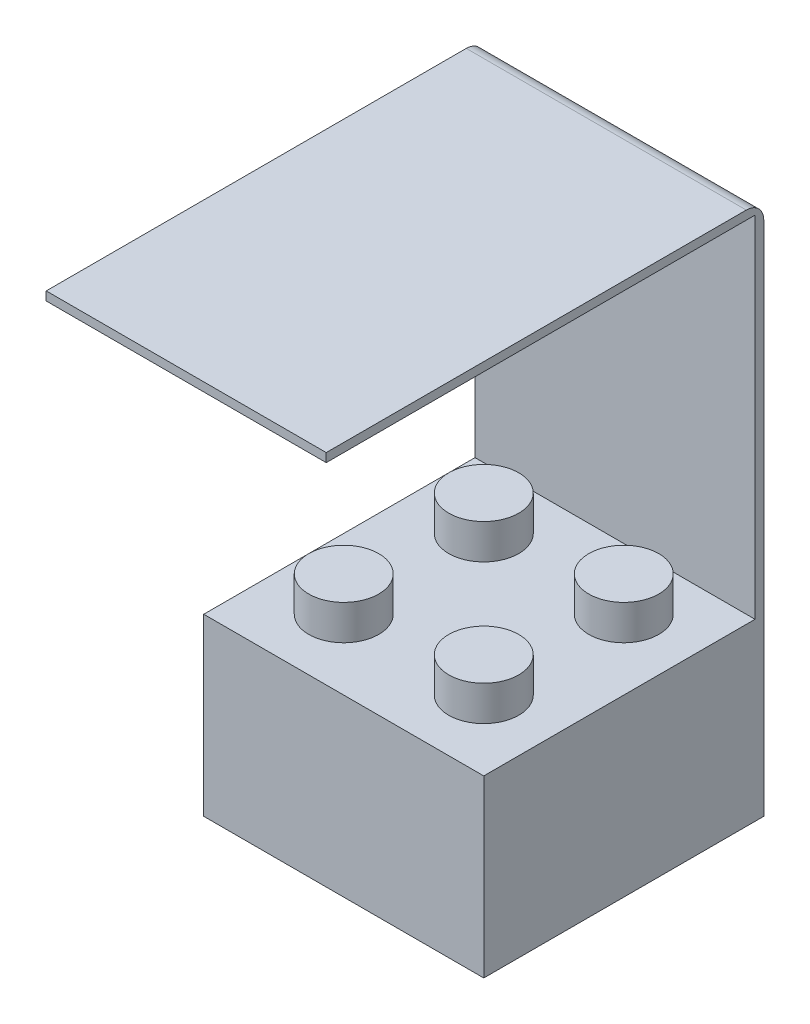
from build123d import *

# Parameters (mm, degrees)
CROQUIS1_W              = 16
CROQUIS1_H              = 16
SALIENTE_EXTRUIR1_DEPTH = 10
CROQUIS2_R              = 2
SALIENTE_EXTRUIR2_DEPTH = 2
VACIADO1_T              = -1
CROQUIS3_R              = 2.7
CROQUIS3_R_2            = 1.7
SALIENTE_EXTRUIR3_DEPTH = 9
SALIENTE_EXTRUIR4_DEPTH = 20
CROQUIS5_W              = 16
CROQUIS5_H              = 25
SALIENTE_EXTRUIR5_DEPTH = 0.5
REDONDEO1_R             = 1


with BuildPart() as part:
    # Croquis1 → Saliente-Extruir1 (new body)
    with BuildSketch(Plane(origin=(0, 0, 0), x_dir=(1, 0, 0), z_dir=(0, 1, 0))):
        Rectangle(CROQUIS1_W, CROQUIS1_H)
    extrude(amount=SALIENTE_EXTRUIR1_DEPTH)

    # Croquis2 → Saliente-Extruir2 (add)
    with BuildSketch(Plane(origin=(0, 10, 0), x_dir=(1, 0, 0), z_dir=(0, 1, 0))):
        with Locations(Location((-4, 4, 0), (0, 0, 270))):
            Circle(CROQUIS2_R)
        with Locations(Location((4, 4, 0), (0, 0, 90))):
            Circle(CROQUIS2_R)
        with Locations(Location((4, -4, 0), (0, 0, 270))):
            Circle(CROQUIS2_R)
        with Locations(Location((-4, -4, 0), (0, 0, 90))):
            Circle(CROQUIS2_R)
    extrude(amount=SALIENTE_EXTRUIR2_DEPTH)

    # Vaciado1
    vaciado1_openings = [part.faces().sort_by_distance(p)[0] for p in [
        (0, 0, 0),
    ]]
    offset(amount=VACIADO1_T, openings=vaciado1_openings, kind=Kind.INTERSECTION)

    # Croquis3 → Saliente-Extruir3 (add)
    with BuildSketch(Plane(origin=(0, 9, 0), x_dir=(-1, 0, 0), z_dir=(0, -1, 0))):
        with Locations(Location((0, 0, 0), (0, 0, 270))):
            Circle(CROQUIS3_R)
        with Locations(Location((0, 0, 0), (0, 0, 90))):
            Circle(CROQUIS3_R_2, mode=Mode.SUBTRACT)
    extrude(amount=SALIENTE_EXTRUIR3_DEPTH)

    # Croquis4 → Saliente-Extruir4 (add)
    with BuildSketch(Plane(origin=(0, 10, 0), x_dir=(1, 0, 0), z_dir=(0, 1, 0))):
        Polygon((-8, 8), (8, 8), (8, 7.5), (7.5, 7.5), (-7.5, 7.5), (-8, 7.5), align=None)
    extrude(amount=SALIENTE_EXTRUIR4_DEPTH)

    # Croquis5 → Saliente-Extruir5 (add)
    with BuildSketch(Plane(origin=(0, 30, 0), x_dir=(1, 0, 0), z_dir=(0, 1, 0))):
        with Locations((0, -4.5)):
            Rectangle(CROQUIS5_W, CROQUIS5_H)
    extrude(amount=SALIENTE_EXTRUIR5_DEPTH)

    # Redondeo1
    redondeo1_edges = [part.edges().sort_by_distance(p)[0] for p in [
        (0, 30.5, -8),
    ]]
    fillet(redondeo1_edges, radius=REDONDEO1_R)


solid = part.part
